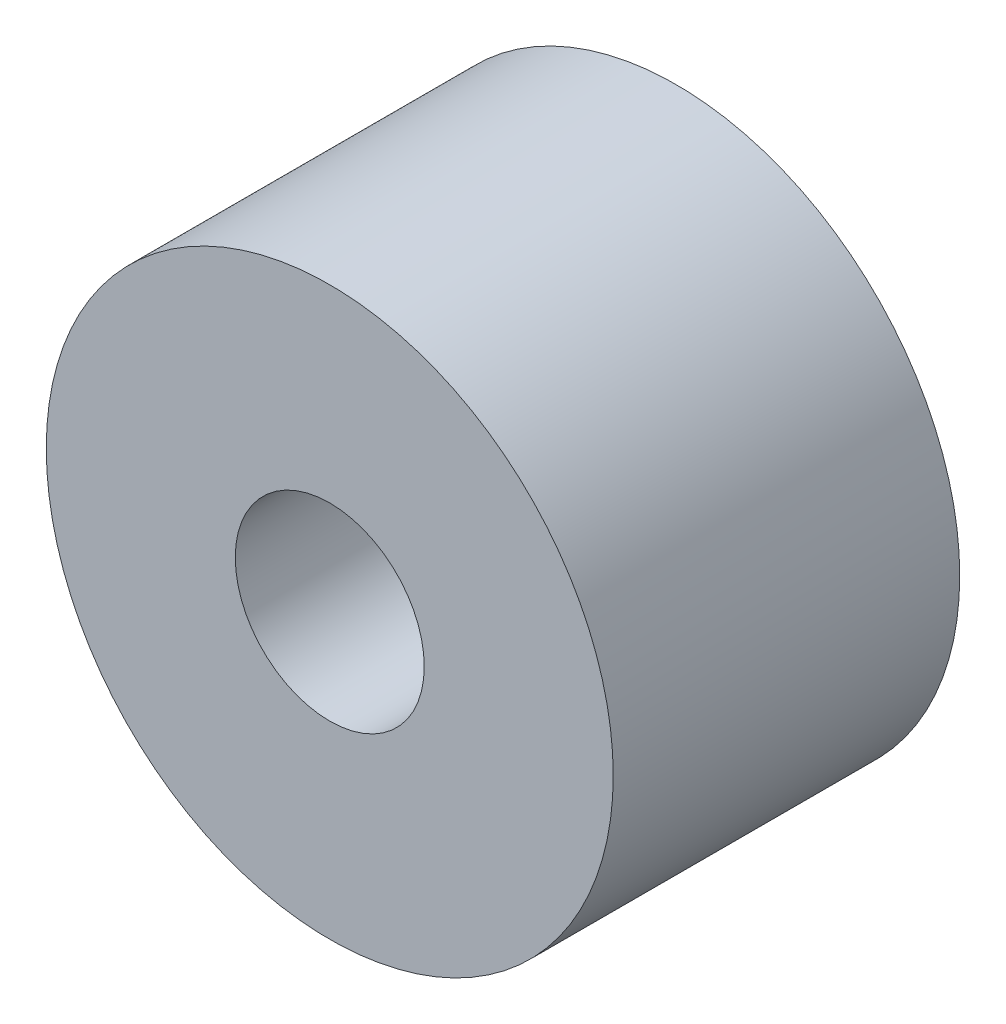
from build123d import *

# Parameters (mm, degrees)
SKETCH1_W = 5.5
SKETCH1_H = 3


with BuildPart() as part:
    # Sketch1 → Revolve1 (revolve)
    with BuildSketch(Plane(origin=(0, 0, 0), x_dir=(0, 0, -1), z_dir=(1, 0, 0)), mode=Mode.PRIVATE) as revolve1_sk:
        with Locations((0.25, -3)):
            Rectangle(SKETCH1_W, SKETCH1_H)
    revolve(revolve1_sk.sketch.rotate(Axis((0, 0, 0), (0, 0, 1)), 270), axis=Axis((0, 0, 0), (0, 0, 1)))


solid = part.part
